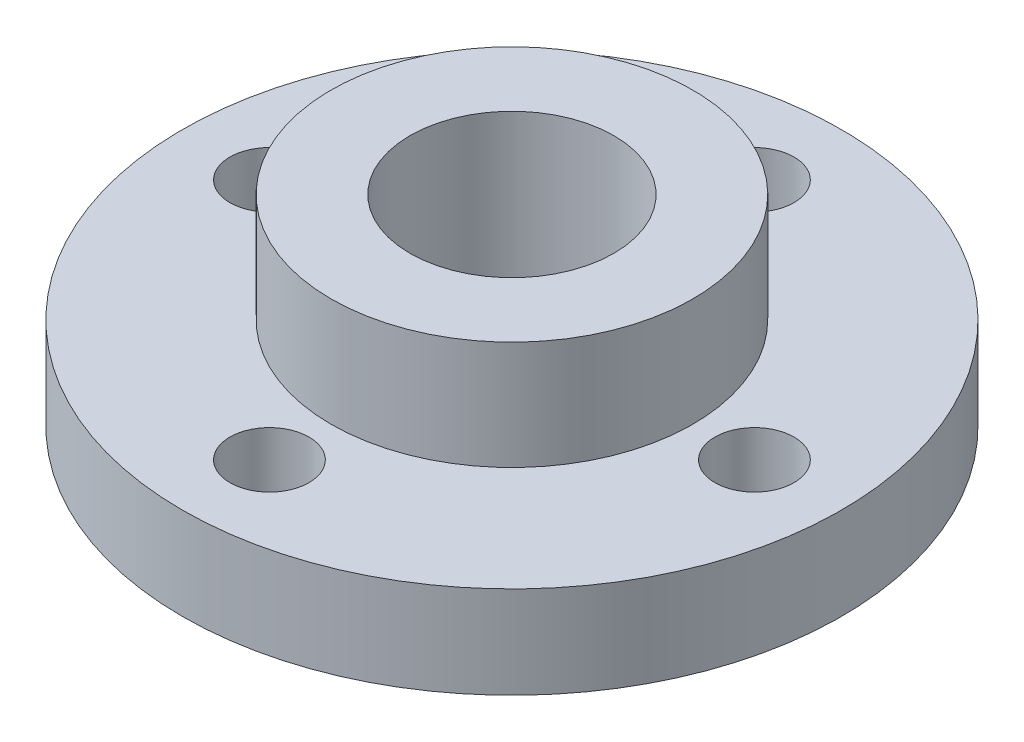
ISO-10303-21;
HEADER;
FILE_DESCRIPTION(('STEP AP214'),'2;1');
FILE_NAME('part.step','',(''),(''),'','','');
FILE_SCHEMA(('AUTOMOTIVE_DESIGN { 1 0 10303 214 1 1 1 1 }'));
ENDSEC;
DATA;
#1=APPLICATION_CONTEXT('core data for automotive mechanical design processes');
#2=APPLICATION_PROTOCOL_DEFINITION('international standard','automotive_design',2000,#1);
#3=PRODUCT_CONTEXT('',#1,'mechanical');
#4=PRODUCT('Part','Part','',(#3));
#5=PRODUCT_RELATED_PRODUCT_CATEGORY('part','',(#4));
#6=PRODUCT_DEFINITION_FORMATION('','',#4);
#7=PRODUCT_DEFINITION_CONTEXT('part definition',#1,'design');
#8=PRODUCT_DEFINITION('design','',#6,#7);
#9=PRODUCT_DEFINITION_SHAPE('','',#8);
#10=(LENGTH_UNIT() NAMED_UNIT(*) SI_UNIT(.MILLI.,.METRE.));
#11=(NAMED_UNIT(*) PLANE_ANGLE_UNIT() SI_UNIT($,.RADIAN.));
#12=(NAMED_UNIT(*) SI_UNIT($,.STERADIAN.) SOLID_ANGLE_UNIT());
#13=UNCERTAINTY_MEASURE_WITH_UNIT(LENGTH_MEASURE(1.E-05),#10,'distance_accuracy_value','');
#14=(GEOMETRIC_REPRESENTATION_CONTEXT(3) GLOBAL_UNCERTAINTY_ASSIGNED_CONTEXT((#13)) GLOBAL_UNIT_ASSIGNED_CONTEXT((#10,
#11,#12)) REPRESENTATION_CONTEXT('',''));
#15=CARTESIAN_POINT('',(0.,0.,0.));
#16=DIRECTION('',(0.,0.,1.));
#17=DIRECTION('',(1.,0.,0.));
#18=AXIS2_PLACEMENT_3D('',#15,#16,#17);
#19=CARTESIAN_POINT('',(0.,15.0876,0.));
#20=DIRECTION('',(0.,1.,0.));
#21=DIRECTION('',(0.,0.,1.));
#22=AXIS2_PLACEMENT_3D('',#19,#20,#21);
#23=PLANE('',#22);
#24=CARTESIAN_POINT('',(0.,15.0876,0.));
#25=DIRECTION('',(0.,1.,0.));
#26=DIRECTION('',(0.,0.,1.));
#27=AXIS2_PLACEMENT_3D('',#24,#25,#26);
#28=CIRCLE('',#27,53.975);
#29=CARTESIAN_POINT('',(0.,15.0876,53.975));
#30=VERTEX_POINT('',#29);
#31=EDGE_CURVE('E10',#30,#30,#28,.T.);
#32=ORIENTED_EDGE('',*,*,#31,.T.);
#33=EDGE_LOOP('',(#32));
#34=FACE_BOUND('',#33,.T.);
#35=CARTESIAN_POINT('',(0.,15.0876,-39.7156471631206));
#36=DIRECTION('',(0.,1.,0.));
#37=DIRECTION('',(0.,0.,1.));
#38=AXIS2_PLACEMENT_3D('',#35,#36,#37);
#39=CIRCLE('',#38,6.477);
#40=CARTESIAN_POINT('',(0.,15.0876,-33.2386471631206));
#41=VERTEX_POINT('',#40);
#42=EDGE_CURVE('E51',#41,#41,#39,.T.);
#43=ORIENTED_EDGE('',*,*,#42,.F.);
#44=EDGE_LOOP('',(#43));
#45=FACE_BOUND('',#44,.T.);
#46=CARTESIAN_POINT('',(39.7156471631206,15.0876,1.38666521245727E-13));
#47=DIRECTION('',(0.,1.,0.));
#48=DIRECTION('',(-1.,0.,0.));
#49=AXIS2_PLACEMENT_3D('',#46,#47,#48);
#50=CIRCLE('',#49,6.477);
#51=CARTESIAN_POINT('',(33.2386471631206,15.0876,1.16052183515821E-13));
#52=VERTEX_POINT('',#51);
#53=EDGE_CURVE('E57',#52,#52,#50,.T.);
#54=ORIENTED_EDGE('',*,*,#53,.F.);
#55=EDGE_LOOP('',(#54));
#56=FACE_BOUND('',#55,.T.);
#57=CARTESIAN_POINT('',(-2.77333042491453E-13,15.0876,39.7156471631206));
#58=DIRECTION('',(0.,1.,0.));
#59=DIRECTION('',(0.,0.,-1.));
#60=AXIS2_PLACEMENT_3D('',#57,#58,#59);
#61=CIRCLE('',#60,6.477);
#62=CARTESIAN_POINT('',(-2.32104367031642E-13,15.0876,33.2386471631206));
#63=VERTEX_POINT('',#62);
#64=EDGE_CURVE('E63',#63,#63,#61,.T.);
#65=ORIENTED_EDGE('',*,*,#64,.F.);
#66=EDGE_LOOP('',(#65));
#67=FACE_BOUND('',#66,.T.);
#68=CARTESIAN_POINT('',(-39.7156471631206,15.0876,-4.1599956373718E-13));
#69=DIRECTION('',(0.,1.,0.));
#70=DIRECTION('',(1.,0.,0.));
#71=AXIS2_PLACEMENT_3D('',#68,#69,#70);
#72=CIRCLE('',#71,6.477);
#73=CARTESIAN_POINT('',(-33.2386471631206,15.0876,-3.48156550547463E-13));
#74=VERTEX_POINT('',#73);
#75=EDGE_CURVE('E69',#74,#74,#72,.T.);
#76=ORIENTED_EDGE('',*,*,#75,.F.);
#77=EDGE_LOOP('',(#76));
#78=FACE_BOUND('',#77,.T.);
#79=CARTESIAN_POINT('',(0.,15.0876,0.));
#80=DIRECTION('',(0.,1.,0.));
#81=DIRECTION('',(0.,0.,1.));
#82=AXIS2_PLACEMENT_3D('',#79,#80,#81);
#83=CIRCLE('',#82,29.6274325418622);
#84=CARTESIAN_POINT('',(0.,15.0876,29.6274325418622));
#85=VERTEX_POINT('',#84);
#86=EDGE_CURVE('E75',#85,#85,#83,.T.);
#87=ORIENTED_EDGE('',*,*,#86,.F.);
#88=EDGE_LOOP('',(#87));
#89=FACE_BOUND('',#88,.T.);
#90=ADVANCED_FACE('F31',(#34,#45,#56,#67,#78,#89),#23,.T.);
#91=CARTESIAN_POINT('',(0.,0.,0.));
#92=DIRECTION('',(0.,1.,0.));
#93=DIRECTION('',(0.,0.,1.));
#94=AXIS2_PLACEMENT_3D('',#91,#92,#93);
#95=PLANE('',#94);
#96=CARTESIAN_POINT('',(-39.7156471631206,0.,-4.1599956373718E-13));
#97=DIRECTION('',(0.,1.,0.));
#98=DIRECTION('',(1.,0.,0.));
#99=AXIS2_PLACEMENT_3D('',#96,#97,#98);
#100=CIRCLE('',#99,6.477);
#101=CARTESIAN_POINT('',(-33.2386471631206,0.,-3.48156550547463E-13));
#102=VERTEX_POINT('',#101);
#103=EDGE_CURVE('E66',#102,#102,#100,.T.);
#104=ORIENTED_EDGE('',*,*,#103,.T.);
#105=EDGE_LOOP('',(#104));
#106=FACE_BOUND('',#105,.T.);
#107=CARTESIAN_POINT('',(-2.77333042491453E-13,0.,39.7156471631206));
#108=DIRECTION('',(0.,1.,0.));
#109=DIRECTION('',(0.,0.,-1.));
#110=AXIS2_PLACEMENT_3D('',#107,#108,#109);
#111=CIRCLE('',#110,6.477);
#112=CARTESIAN_POINT('',(-2.32104367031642E-13,0.,33.2386471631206));
#113=VERTEX_POINT('',#112);
#114=EDGE_CURVE('E60',#113,#113,#111,.T.);
#115=ORIENTED_EDGE('',*,*,#114,.T.);
#116=EDGE_LOOP('',(#115));
#117=FACE_BOUND('',#116,.T.);
#118=CARTESIAN_POINT('',(39.7156471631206,0.,1.38666521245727E-13));
#119=DIRECTION('',(0.,1.,0.));
#120=DIRECTION('',(-1.,0.,0.));
#121=AXIS2_PLACEMENT_3D('',#118,#119,#120);
#122=CIRCLE('',#121,6.477);
#123=CARTESIAN_POINT('',(33.2386471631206,0.,1.16052183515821E-13));
#124=VERTEX_POINT('',#123);
#125=EDGE_CURVE('E54',#124,#124,#122,.T.);
#126=ORIENTED_EDGE('',*,*,#125,.T.);
#127=EDGE_LOOP('',(#126));
#128=FACE_BOUND('',#127,.T.);
#129=CARTESIAN_POINT('',(0.,0.,-39.7156471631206));
#130=DIRECTION('',(0.,1.,0.));
#131=DIRECTION('',(0.,0.,1.));
#132=AXIS2_PLACEMENT_3D('',#129,#130,#131);
#133=CIRCLE('',#132,6.477);
#134=CARTESIAN_POINT('',(0.,0.,-33.2386471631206));
#135=VERTEX_POINT('',#134);
#136=EDGE_CURVE('E46',#135,#135,#133,.T.);
#137=ORIENTED_EDGE('',*,*,#136,.T.);
#138=EDGE_LOOP('',(#137));
#139=FACE_BOUND('',#138,.T.);
#140=CARTESIAN_POINT('',(0.,0.,0.));
#141=DIRECTION('',(0.,1.,0.));
#142=DIRECTION('',(0.,0.,1.));
#143=AXIS2_PLACEMENT_3D('',#140,#141,#142);
#144=CIRCLE('',#143,53.975);
#145=CARTESIAN_POINT('',(0.,0.,53.975));
#146=VERTEX_POINT('',#145);
#147=EDGE_CURVE('E38',#146,#146,#144,.T.);
#148=ORIENTED_EDGE('',*,*,#147,.F.);
#149=EDGE_LOOP('',(#148));
#150=FACE_BOUND('',#149,.T.);
#151=CARTESIAN_POINT('',(0.,0.,0.));
#152=DIRECTION('',(0.,1.,0.));
#153=DIRECTION('',(0.,0.,1.));
#154=AXIS2_PLACEMENT_3D('',#151,#152,#153);
#155=CIRCLE('',#154,16.7005);
#156=CARTESIAN_POINT('',(0.,0.,16.7005));
#157=VERTEX_POINT('',#156);
#158=EDGE_CURVE('E42',#157,#157,#155,.T.);
#159=ORIENTED_EDGE('',*,*,#158,.T.);
#160=EDGE_LOOP('',(#159));
#161=FACE_BOUND('',#160,.T.);
#162=ADVANCED_FACE('F100',(#106,#117,#128,#139,#150,#161),#95,.F.);
#163=CARTESIAN_POINT('',(0.,15.0876,0.));
#164=DIRECTION('',(0.,-1.,0.));
#165=DIRECTION('',(0.,0.,-1.));
#166=AXIS2_PLACEMENT_3D('',#163,#164,#165);
#167=CYLINDRICAL_SURFACE('',#166,53.975);
#168=ORIENTED_EDGE('',*,*,#31,.F.);
#169=EDGE_LOOP('',(#168));
#170=FACE_BOUND('',#169,.T.);
#171=ORIENTED_EDGE('',*,*,#147,.T.);
#172=EDGE_LOOP('',(#171));
#173=FACE_BOUND('',#172,.T.);
#174=ADVANCED_FACE('F33',(#170,#173),#167,.T.);
#175=CARTESIAN_POINT('',(0.,15.0876,0.));
#176=DIRECTION('',(0.,-1.,0.));
#177=DIRECTION('',(0.,0.,-1.));
#178=AXIS2_PLACEMENT_3D('',#175,#176,#177);
#179=CYLINDRICAL_SURFACE('',#178,16.7005);
#180=ORIENTED_EDGE('',*,*,#158,.F.);
#181=EDGE_LOOP('',(#180));
#182=FACE_BOUND('',#181,.T.);
#183=CARTESIAN_POINT('',(0.,32.8676,0.));
#184=DIRECTION('',(0.,1.,0.));
#185=DIRECTION('',(0.,0.,1.));
#186=AXIS2_PLACEMENT_3D('',#183,#184,#185);
#187=CIRCLE('',#186,16.7005);
#188=CARTESIAN_POINT('',(0.,32.8676,16.7005));
#189=VERTEX_POINT('',#188);
#190=EDGE_CURVE('E78',#189,#189,#187,.T.);
#191=ORIENTED_EDGE('',*,*,#190,.T.);
#192=EDGE_LOOP('',(#191));
#193=FACE_BOUND('',#192,.T.);
#194=ADVANCED_FACE('F82',(#182,#193),#179,.F.);
#195=CARTESIAN_POINT('',(0.,0.,-39.7156471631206));
#196=DIRECTION('',(0.,1.,0.));
#197=DIRECTION('',(0.,0.,1.));
#198=AXIS2_PLACEMENT_3D('',#195,#196,#197);
#199=CYLINDRICAL_SURFACE('',#198,6.477);
#200=ORIENTED_EDGE('',*,*,#136,.F.);
#201=EDGE_LOOP('',(#200));
#202=FACE_BOUND('',#201,.T.);
#203=ORIENTED_EDGE('',*,*,#42,.T.);
#204=EDGE_LOOP('',(#203));
#205=FACE_BOUND('',#204,.T.);
#206=ADVANCED_FACE('F110',(#202,#205),#199,.F.);
#207=CARTESIAN_POINT('',(39.7156471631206,0.,1.38666521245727E-13));
#208=DIRECTION('',(0.,1.,0.));
#209=DIRECTION('',(0.,0.,1.));
#210=AXIS2_PLACEMENT_3D('',#207,#208,#209);
#211=CYLINDRICAL_SURFACE('',#210,6.477);
#212=ORIENTED_EDGE('',*,*,#125,.F.);
#213=EDGE_LOOP('',(#212));
#214=FACE_BOUND('',#213,.T.);
#215=ORIENTED_EDGE('',*,*,#53,.T.);
#216=EDGE_LOOP('',(#215));
#217=FACE_BOUND('',#216,.T.);
#218=ADVANCED_FACE('F114',(#214,#217),#211,.F.);
#219=CARTESIAN_POINT('',(-2.77333042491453E-13,0.,39.7156471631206));
#220=DIRECTION('',(0.,1.,0.));
#221=DIRECTION('',(0.,0.,1.));
#222=AXIS2_PLACEMENT_3D('',#219,#220,#221);
#223=CYLINDRICAL_SURFACE('',#222,6.477);
#224=ORIENTED_EDGE('',*,*,#114,.F.);
#225=EDGE_LOOP('',(#224));
#226=FACE_BOUND('',#225,.T.);
#227=ORIENTED_EDGE('',*,*,#64,.T.);
#228=EDGE_LOOP('',(#227));
#229=FACE_BOUND('',#228,.T.);
#230=ADVANCED_FACE('F96',(#226,#229),#223,.F.);
#231=CARTESIAN_POINT('',(-39.7156471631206,0.,-4.1599956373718E-13));
#232=DIRECTION('',(0.,1.,0.));
#233=DIRECTION('',(0.,0.,1.));
#234=AXIS2_PLACEMENT_3D('',#231,#232,#233);
#235=CYLINDRICAL_SURFACE('',#234,6.477);
#236=ORIENTED_EDGE('',*,*,#103,.F.);
#237=EDGE_LOOP('',(#236));
#238=FACE_BOUND('',#237,.T.);
#239=ORIENTED_EDGE('',*,*,#75,.T.);
#240=EDGE_LOOP('',(#239));
#241=FACE_BOUND('',#240,.T.);
#242=ADVANCED_FACE('F87',(#238,#241),#235,.F.);
#243=CARTESIAN_POINT('',(0.,32.8676,0.));
#244=DIRECTION('',(0.,1.,0.));
#245=DIRECTION('',(0.,0.,1.));
#246=AXIS2_PLACEMENT_3D('',#243,#244,#245);
#247=PLANE('',#246);
#248=CARTESIAN_POINT('',(0.,32.8676,0.));
#249=DIRECTION('',(0.,1.,0.));
#250=DIRECTION('',(0.,0.,1.));
#251=AXIS2_PLACEMENT_3D('',#248,#249,#250);
#252=CIRCLE('',#251,29.6274325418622);
#253=CARTESIAN_POINT('',(0.,32.8676,29.6274325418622));
#254=VERTEX_POINT('',#253);
#255=EDGE_CURVE('E72',#254,#254,#252,.T.);
#256=ORIENTED_EDGE('',*,*,#255,.T.);
#257=EDGE_LOOP('',(#256));
#258=FACE_BOUND('',#257,.T.);
#259=ORIENTED_EDGE('',*,*,#190,.F.);
#260=EDGE_LOOP('',(#259));
#261=FACE_BOUND('',#260,.T.);
#262=ADVANCED_FACE('F84',(#258,#261),#247,.T.);
#263=CARTESIAN_POINT('',(0.,32.8676,0.));
#264=DIRECTION('',(0.,-1.,0.));
#265=DIRECTION('',(0.,0.,-1.));
#266=AXIS2_PLACEMENT_3D('',#263,#264,#265);
#267=CYLINDRICAL_SURFACE('',#266,29.6274325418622);
#268=ORIENTED_EDGE('',*,*,#255,.F.);
#269=EDGE_LOOP('',(#268));
#270=FACE_BOUND('',#269,.T.);
#271=ORIENTED_EDGE('',*,*,#86,.T.);
#272=EDGE_LOOP('',(#271));
#273=FACE_BOUND('',#272,.T.);
#274=ADVANCED_FACE('F86',(#270,#273),#267,.T.);
#275=CLOSED_SHELL('',(#90,#162,#174,#194,#206,#218,#230,#242,#262,#274));
#276=MANIFOLD_SOLID_BREP('B2',#275);
#277=ADVANCED_BREP_SHAPE_REPRESENTATION('',(#18,#276),#14);
#278=SHAPE_DEFINITION_REPRESENTATION(#9,#277);
ENDSEC;
END-ISO-10303-21;
